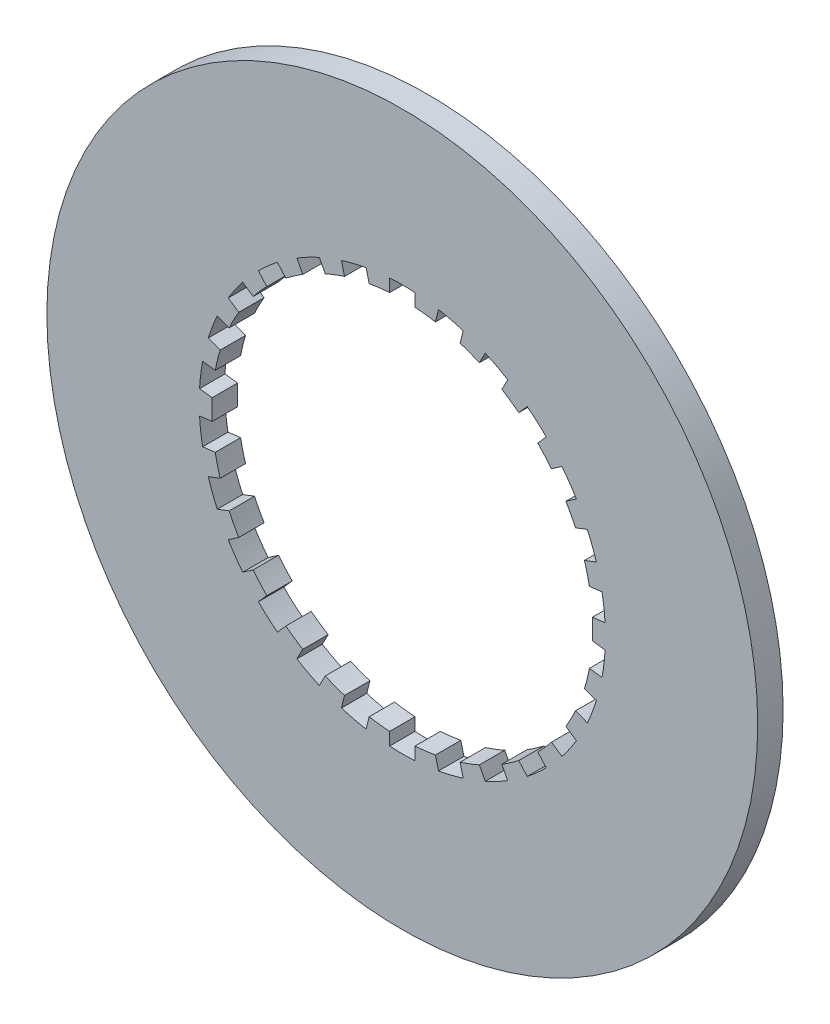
from build123d import *

# Parameters (mm, degrees)
EXTRUSION1_DEPTH             = 1
EXTRUSION1_DEPTH_BACK        = 1
ESQUISSE1_R                  = 28
ESQUISSE3_R                  = 15
ENL_V_MAT_EXTRU_1_DEPTH      = 40.648455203
ENL_V_MAT_EXTRU_2_DEPTH      = 2
R_P_TITION_CIRCULAIRE1_COUNT = 26


with BuildPart() as part:
    # Esquisse1 → Extrusion1 (new, two sides: drawn at the far end of the back side and taken through both)
    with BuildSketch(Plane.XY.offset(-EXTRUSION1_DEPTH_BACK)):
        Circle(ESQUISSE1_R)
    extrude(amount=EXTRUSION1_DEPTH + EXTRUSION1_DEPTH_BACK)

    # Esquisse3 → Enl_v. mat.-Extru.1 (cut, through all)
    with BuildSketch(Plane(origin=(0, 0, -1), x_dir=(-1, 0, 0), z_dir=(0, 0, -1))):
        Circle(ESQUISSE3_R)
    extrude(amount=-ENL_V_MAT_EXTRU_1_DEPTH, mode=Mode.SUBTRACT)

    # Esquisse4 → Enl_v. mat.-Extru.2 (cut)
    with BuildSketch(Plane.XY.offset(1)):
        with BuildLine():
            Line((-1, 14.966629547), (-0.611771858, 14.053088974))
            Line((-0.611771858, 14.053088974), (1, 14.966629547))
            Line((1, 14.966629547), (1, 15.968719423))
            ThreePointArc((1, 15.968719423), (0, 16), (-1, 15.968719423))
            Line((-1, 15.968719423), (-1, 14.966629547))
        make_face()
    enl_v_mat_extru_2 = extrude(amount=-ENL_V_MAT_EXTRU_2_DEPTH, mode=Mode.SUBTRACT)

    # R_p_tition circulaire1: Enl_v. mat.-Extru.2 ×26 about axis
    r_p_tition_circulaire1_axis = Axis((0, 0, 0), (0, 0, 1))
    for i in range(1, R_P_TITION_CIRCULAIRE1_COUNT):
        add(enl_v_mat_extru_2.rotate(r_p_tition_circulaire1_axis, i * 360 / R_P_TITION_CIRCULAIRE1_COUNT), mode=Mode.SUBTRACT)


solid = part.part
